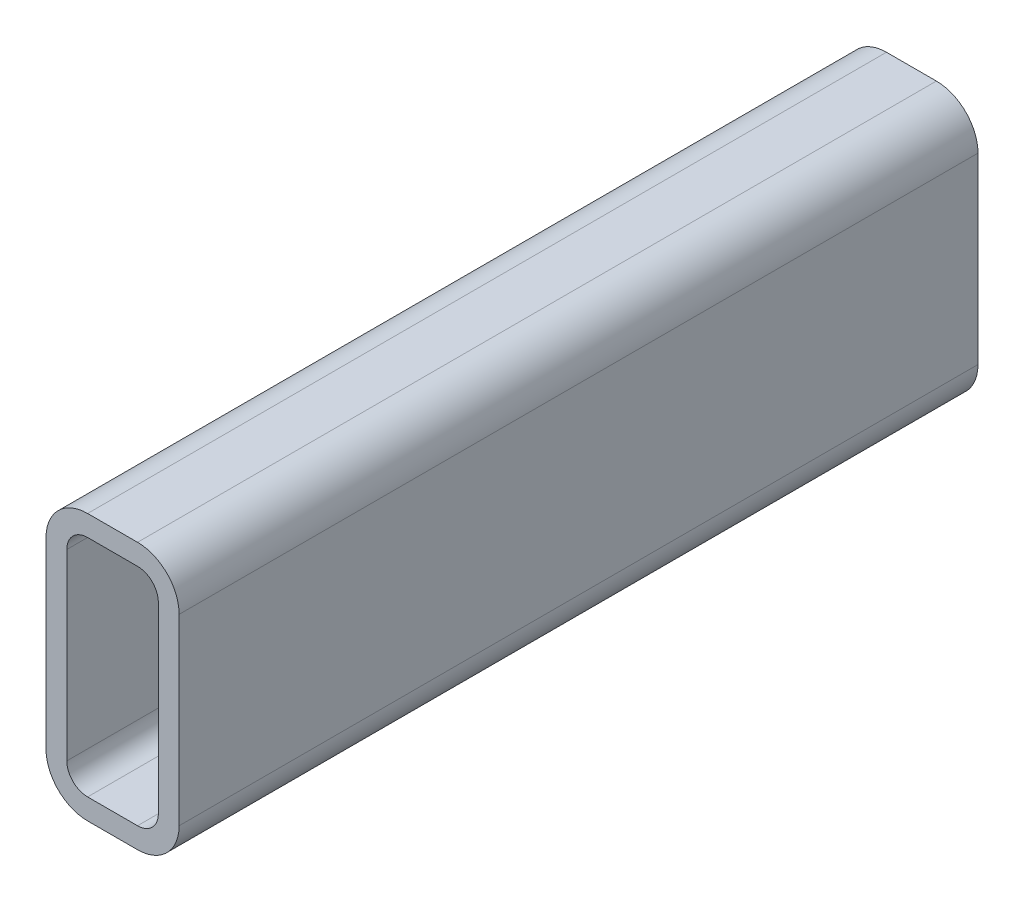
ISO-10303-21;
HEADER;
FILE_DESCRIPTION(('STEP AP214'),'2;1');
FILE_NAME('part.step','',(''),(''),'','','');
FILE_SCHEMA(('AUTOMOTIVE_DESIGN { 1 0 10303 214 1 1 1 1 }'));
ENDSEC;
DATA;
#1=APPLICATION_CONTEXT('core data for automotive mechanical design processes');
#2=APPLICATION_PROTOCOL_DEFINITION('international standard','automotive_design',2000,#1);
#3=PRODUCT_CONTEXT('',#1,'mechanical');
#4=PRODUCT('Part','Part','',(#3));
#5=PRODUCT_RELATED_PRODUCT_CATEGORY('part','',(#4));
#6=PRODUCT_DEFINITION_FORMATION('','',#4);
#7=PRODUCT_DEFINITION_CONTEXT('part definition',#1,'design');
#8=PRODUCT_DEFINITION('design','',#6,#7);
#9=PRODUCT_DEFINITION_SHAPE('','',#8);
#10=(LENGTH_UNIT() NAMED_UNIT(*) SI_UNIT(.MILLI.,.METRE.));
#11=(NAMED_UNIT(*) PLANE_ANGLE_UNIT() SI_UNIT($,.RADIAN.));
#12=(NAMED_UNIT(*) SI_UNIT($,.STERADIAN.) SOLID_ANGLE_UNIT());
#13=UNCERTAINTY_MEASURE_WITH_UNIT(LENGTH_MEASURE(1.E-05),#10,'distance_accuracy_value','');
#14=(GEOMETRIC_REPRESENTATION_CONTEXT(3) GLOBAL_UNCERTAINTY_ASSIGNED_CONTEXT((#13)) GLOBAL_UNIT_ASSIGNED_CONTEXT((#10,
#11,#12)) REPRESENTATION_CONTEXT('',''));
#15=CARTESIAN_POINT('',(0.,0.,0.));
#16=DIRECTION('',(0.,0.,1.));
#17=DIRECTION('',(1.,0.,0.));
#18=AXIS2_PLACEMENT_3D('',#15,#16,#17);
#19=CARTESIAN_POINT('',(15.875,85.725,304.8));
#20=DIRECTION('',(0.,0.,1.));
#21=DIRECTION('',(1.,0.,0.));
#22=AXIS2_PLACEMENT_3D('',#19,#20,#21);
#23=PLANE('',#22);
#24=CARTESIAN_POINT('',(15.875,85.725,304.8));
#25=DIRECTION('',(0.,0.,1.));
#26=DIRECTION('',(1.,0.,0.));
#27=AXIS2_PLACEMENT_3D('',#24,#25,#26);
#28=CIRCLE('',#27,15.875);
#29=CARTESIAN_POINT('',(15.875,101.6,304.8));
#30=VERTEX_POINT('',#29);
#31=CARTESIAN_POINT('',(0.,85.725,304.8));
#32=VERTEX_POINT('',#31);
#33=EDGE_CURVE('E211',#30,#32,#28,.T.);
#34=ORIENTED_EDGE('',*,*,#33,.T.);
#35=DIRECTION('',(0.,-1.,0.));
#36=VECTOR('',#35,1.);
#37=CARTESIAN_POINT('',(0.,15.875,304.8));
#38=LINE('',#37,#36);
#39=CARTESIAN_POINT('',(0.,15.875,304.8));
#40=VERTEX_POINT('',#39);
#41=EDGE_CURVE('E214',#32,#40,#38,.T.);
#42=ORIENTED_EDGE('',*,*,#41,.T.);
#43=CARTESIAN_POINT('',(15.875,15.875,304.8));
#44=DIRECTION('',(0.,0.,1.));
#45=DIRECTION('',(1.,0.,0.));
#46=AXIS2_PLACEMENT_3D('',#43,#44,#45);
#47=CIRCLE('',#46,15.875);
#48=CARTESIAN_POINT('',(15.875,0.,304.8));
#49=VERTEX_POINT('',#48);
#50=EDGE_CURVE('E217',#40,#49,#47,.T.);
#51=ORIENTED_EDGE('',*,*,#50,.T.);
#52=DIRECTION('',(1.,0.,0.));
#53=VECTOR('',#52,1.);
#54=CARTESIAN_POINT('',(34.925,0.,304.8));
#55=LINE('',#54,#53);
#56=CARTESIAN_POINT('',(34.925,0.,304.8));
#57=VERTEX_POINT('',#56);
#58=EDGE_CURVE('E219',#49,#57,#55,.T.);
#59=ORIENTED_EDGE('',*,*,#58,.T.);
#60=CARTESIAN_POINT('',(34.925,15.875,304.8));
#61=DIRECTION('',(0.,0.,1.));
#62=DIRECTION('',(1.,0.,0.));
#63=AXIS2_PLACEMENT_3D('',#60,#61,#62);
#64=CIRCLE('',#63,15.875);
#65=CARTESIAN_POINT('',(50.8,15.875,304.8));
#66=VERTEX_POINT('',#65);
#67=EDGE_CURVE('E221',#57,#66,#64,.T.);
#68=ORIENTED_EDGE('',*,*,#67,.T.);
#69=DIRECTION('',(0.,1.,0.));
#70=VECTOR('',#69,1.);
#71=CARTESIAN_POINT('',(50.8,85.725,304.8));
#72=LINE('',#71,#70);
#73=CARTESIAN_POINT('',(50.8,85.725,304.8));
#74=VERTEX_POINT('',#73);
#75=EDGE_CURVE('E223',#66,#74,#72,.T.);
#76=ORIENTED_EDGE('',*,*,#75,.T.);
#77=CARTESIAN_POINT('',(34.925,85.725,304.8));
#78=DIRECTION('',(0.,0.,1.));
#79=DIRECTION('',(1.,0.,0.));
#80=AXIS2_PLACEMENT_3D('',#77,#78,#79);
#81=CIRCLE('',#80,15.875);
#82=CARTESIAN_POINT('',(34.925,101.6,304.8));
#83=VERTEX_POINT('',#82);
#84=EDGE_CURVE('E225',#74,#83,#81,.T.);
#85=ORIENTED_EDGE('',*,*,#84,.T.);
#86=DIRECTION('',(-1.,0.,0.));
#87=VECTOR('',#86,1.);
#88=CARTESIAN_POINT('',(15.875,101.6,304.8));
#89=LINE('',#88,#87);
#90=EDGE_CURVE('E227',#83,#30,#89,.T.);
#91=ORIENTED_EDGE('',*,*,#90,.T.);
#92=EDGE_LOOP('',(#34,#42,#51,#59,#68,#76,#85,#91));
#93=FACE_BOUND('',#92,.T.);
#94=DIRECTION('',(0.,-1.,0.));
#95=VECTOR('',#94,1.);
#96=CARTESIAN_POINT('',(7.9375,15.875,304.8));
#97=LINE('',#96,#95);
#98=CARTESIAN_POINT('',(7.9375,85.725,304.8));
#99=VERTEX_POINT('',#98);
#100=CARTESIAN_POINT('',(7.9375,15.875,304.8));
#101=VERTEX_POINT('',#100);
#102=EDGE_CURVE('E154',#99,#101,#97,.T.);
#103=ORIENTED_EDGE('',*,*,#102,.F.);
#104=CARTESIAN_POINT('',(15.875,85.725,304.8));
#105=DIRECTION('',(0.,0.,1.));
#106=DIRECTION('',(1.,0.,0.));
#107=AXIS2_PLACEMENT_3D('',#104,#105,#106);
#108=CIRCLE('',#107,7.93750000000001);
#109=CARTESIAN_POINT('',(15.875,93.6625,304.8));
#110=VERTEX_POINT('',#109);
#111=EDGE_CURVE('E146',#110,#99,#108,.T.);
#112=ORIENTED_EDGE('',*,*,#111,.F.);
#113=DIRECTION('',(-1.,0.,0.));
#114=VECTOR('',#113,1.);
#115=CARTESIAN_POINT('',(15.875,93.6625,304.8));
#116=LINE('',#115,#114);
#117=CARTESIAN_POINT('',(34.925,93.6625,304.8));
#118=VERTEX_POINT('',#117);
#119=EDGE_CURVE('E179',#118,#110,#116,.T.);
#120=ORIENTED_EDGE('',*,*,#119,.F.);
#121=CARTESIAN_POINT('',(34.925,85.725,304.8));
#122=DIRECTION('',(0.,0.,1.));
#123=DIRECTION('',(1.,0.,0.));
#124=AXIS2_PLACEMENT_3D('',#121,#122,#123);
#125=CIRCLE('',#124,7.93750000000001);
#126=CARTESIAN_POINT('',(42.8625,85.725,304.8));
#127=VERTEX_POINT('',#126);
#128=EDGE_CURVE('E177',#127,#118,#125,.T.);
#129=ORIENTED_EDGE('',*,*,#128,.F.);
#130=DIRECTION('',(0.,1.,0.));
#131=VECTOR('',#130,1.);
#132=CARTESIAN_POINT('',(42.8625,85.725,304.8));
#133=LINE('',#132,#131);
#134=CARTESIAN_POINT('',(42.8625,15.875,304.8));
#135=VERTEX_POINT('',#134);
#136=EDGE_CURVE('E175',#135,#127,#133,.T.);
#137=ORIENTED_EDGE('',*,*,#136,.F.);
#138=CARTESIAN_POINT('',(34.925,15.875,304.8));
#139=DIRECTION('',(0.,0.,1.));
#140=DIRECTION('',(1.,0.,0.));
#141=AXIS2_PLACEMENT_3D('',#138,#139,#140);
#142=CIRCLE('',#141,7.9375);
#143=CARTESIAN_POINT('',(34.925,7.9375,304.8));
#144=VERTEX_POINT('',#143);
#145=EDGE_CURVE('E173',#144,#135,#142,.T.);
#146=ORIENTED_EDGE('',*,*,#145,.F.);
#147=DIRECTION('',(1.,0.,0.));
#148=VECTOR('',#147,1.);
#149=CARTESIAN_POINT('',(34.925,7.9375,304.8));
#150=LINE('',#149,#148);
#151=CARTESIAN_POINT('',(15.875,7.9375,304.8));
#152=VERTEX_POINT('',#151);
#153=EDGE_CURVE('E169',#152,#144,#150,.T.);
#154=ORIENTED_EDGE('',*,*,#153,.F.);
#155=CARTESIAN_POINT('',(15.875,15.875,304.8));
#156=DIRECTION('',(0.,0.,1.));
#157=DIRECTION('',(1.,0.,0.));
#158=AXIS2_PLACEMENT_3D('',#155,#156,#157);
#159=CIRCLE('',#158,7.9375);
#160=EDGE_CURVE('E167',#101,#152,#159,.T.);
#161=ORIENTED_EDGE('',*,*,#160,.F.);
#162=EDGE_LOOP('',(#103,#112,#120,#129,#137,#146,#154,#161));
#163=FACE_BOUND('',#162,.T.);
#164=ADVANCED_FACE('F33',(#93,#163),#23,.T.);
#165=CARTESIAN_POINT('',(15.875,85.725,0.));
#166=DIRECTION('',(0.,0.,1.));
#167=DIRECTION('',(1.,0.,0.));
#168=AXIS2_PLACEMENT_3D('',#165,#166,#167);
#169=PLANE('',#168);
#170=CARTESIAN_POINT('',(15.875,85.725,0.));
#171=DIRECTION('',(0.,0.,1.));
#172=DIRECTION('',(1.,0.,0.));
#173=AXIS2_PLACEMENT_3D('',#170,#171,#172);
#174=CIRCLE('',#173,15.875);
#175=CARTESIAN_POINT('',(15.875,101.6,0.));
#176=VERTEX_POINT('',#175);
#177=CARTESIAN_POINT('',(0.,85.725,0.));
#178=VERTEX_POINT('',#177);
#179=EDGE_CURVE('E162',#176,#178,#174,.T.);
#180=ORIENTED_EDGE('',*,*,#179,.F.);
#181=DIRECTION('',(-1.,0.,0.));
#182=VECTOR('',#181,1.);
#183=CARTESIAN_POINT('',(15.875,101.6,0.));
#184=LINE('',#183,#182);
#185=CARTESIAN_POINT('',(34.925,101.6,0.));
#186=VERTEX_POINT('',#185);
#187=EDGE_CURVE('E215',#186,#176,#184,.T.);
#188=ORIENTED_EDGE('',*,*,#187,.F.);
#189=CARTESIAN_POINT('',(34.925,85.725,0.));
#190=DIRECTION('',(0.,0.,1.));
#191=DIRECTION('',(1.,0.,0.));
#192=AXIS2_PLACEMENT_3D('',#189,#190,#191);
#193=CIRCLE('',#192,15.875);
#194=CARTESIAN_POINT('',(50.8,85.725,0.));
#195=VERTEX_POINT('',#194);
#196=EDGE_CURVE('E242',#195,#186,#193,.T.);
#197=ORIENTED_EDGE('',*,*,#196,.F.);
#198=DIRECTION('',(0.,1.,0.));
#199=VECTOR('',#198,1.);
#200=CARTESIAN_POINT('',(50.8,85.725,0.));
#201=LINE('',#200,#199);
#202=CARTESIAN_POINT('',(50.8,15.875,0.));
#203=VERTEX_POINT('',#202);
#204=EDGE_CURVE('E240',#203,#195,#201,.T.);
#205=ORIENTED_EDGE('',*,*,#204,.F.);
#206=CARTESIAN_POINT('',(34.925,15.875,0.));
#207=DIRECTION('',(0.,0.,1.));
#208=DIRECTION('',(1.,0.,0.));
#209=AXIS2_PLACEMENT_3D('',#206,#207,#208);
#210=CIRCLE('',#209,15.875);
#211=CARTESIAN_POINT('',(34.925,0.,0.));
#212=VERTEX_POINT('',#211);
#213=EDGE_CURVE('E238',#212,#203,#210,.T.);
#214=ORIENTED_EDGE('',*,*,#213,.F.);
#215=DIRECTION('',(1.,0.,0.));
#216=VECTOR('',#215,1.);
#217=CARTESIAN_POINT('',(34.925,0.,0.));
#218=LINE('',#217,#216);
#219=CARTESIAN_POINT('',(15.875,0.,0.));
#220=VERTEX_POINT('',#219);
#221=EDGE_CURVE('E236',#220,#212,#218,.T.);
#222=ORIENTED_EDGE('',*,*,#221,.F.);
#223=CARTESIAN_POINT('',(15.875,15.875,0.));
#224=DIRECTION('',(0.,0.,1.));
#225=DIRECTION('',(1.,0.,0.));
#226=AXIS2_PLACEMENT_3D('',#223,#224,#225);
#227=CIRCLE('',#226,15.875);
#228=CARTESIAN_POINT('',(0.,15.875,0.));
#229=VERTEX_POINT('',#228);
#230=EDGE_CURVE('E234',#229,#220,#227,.T.);
#231=ORIENTED_EDGE('',*,*,#230,.F.);
#232=DIRECTION('',(0.,-1.,0.));
#233=VECTOR('',#232,1.);
#234=CARTESIAN_POINT('',(0.,15.875,0.));
#235=LINE('',#234,#233);
#236=EDGE_CURVE('E232',#178,#229,#235,.T.);
#237=ORIENTED_EDGE('',*,*,#236,.F.);
#238=EDGE_LOOP('',(#180,#188,#197,#205,#214,#222,#231,#237));
#239=FACE_BOUND('',#238,.T.);
#240=CARTESIAN_POINT('',(15.875,85.725,0.));
#241=DIRECTION('',(0.,0.,1.));
#242=DIRECTION('',(1.,0.,0.));
#243=AXIS2_PLACEMENT_3D('',#240,#241,#242);
#244=CIRCLE('',#243,7.93750000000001);
#245=CARTESIAN_POINT('',(15.875,93.6625,0.));
#246=VERTEX_POINT('',#245);
#247=CARTESIAN_POINT('',(7.9375,85.725,0.));
#248=VERTEX_POINT('',#247);
#249=EDGE_CURVE('E56',#246,#248,#244,.T.);
#250=ORIENTED_EDGE('',*,*,#249,.T.);
#251=DIRECTION('',(0.,-1.,0.));
#252=VECTOR('',#251,1.);
#253=CARTESIAN_POINT('',(7.9375,15.875,0.));
#254=LINE('',#253,#252);
#255=CARTESIAN_POINT('',(7.9375,15.875,0.));
#256=VERTEX_POINT('',#255);
#257=EDGE_CURVE('E161',#248,#256,#254,.T.);
#258=ORIENTED_EDGE('',*,*,#257,.T.);
#259=CARTESIAN_POINT('',(15.875,15.875,0.));
#260=DIRECTION('',(0.,0.,1.));
#261=DIRECTION('',(1.,0.,0.));
#262=AXIS2_PLACEMENT_3D('',#259,#260,#261);
#263=CIRCLE('',#262,7.9375);
#264=CARTESIAN_POINT('',(15.875,7.9375,0.));
#265=VERTEX_POINT('',#264);
#266=EDGE_CURVE('E183',#256,#265,#263,.T.);
#267=ORIENTED_EDGE('',*,*,#266,.T.);
#268=DIRECTION('',(1.,0.,0.));
#269=VECTOR('',#268,1.);
#270=CARTESIAN_POINT('',(34.925,7.9375,0.));
#271=LINE('',#270,#269);
#272=CARTESIAN_POINT('',(34.925,7.9375,0.));
#273=VERTEX_POINT('',#272);
#274=EDGE_CURVE('E186',#265,#273,#271,.T.);
#275=ORIENTED_EDGE('',*,*,#274,.T.);
#276=CARTESIAN_POINT('',(34.925,15.875,0.));
#277=DIRECTION('',(0.,0.,1.));
#278=DIRECTION('',(1.,0.,0.));
#279=AXIS2_PLACEMENT_3D('',#276,#277,#278);
#280=CIRCLE('',#279,7.9375);
#281=CARTESIAN_POINT('',(42.8625,15.875,0.));
#282=VERTEX_POINT('',#281);
#283=EDGE_CURVE('E189',#273,#282,#280,.T.);
#284=ORIENTED_EDGE('',*,*,#283,.T.);
#285=DIRECTION('',(0.,1.,0.));
#286=VECTOR('',#285,1.);
#287=CARTESIAN_POINT('',(42.8625,85.725,0.));
#288=LINE('',#287,#286);
#289=CARTESIAN_POINT('',(42.8625,85.725,0.));
#290=VERTEX_POINT('',#289);
#291=EDGE_CURVE('E192',#282,#290,#288,.T.);
#292=ORIENTED_EDGE('',*,*,#291,.T.);
#293=CARTESIAN_POINT('',(34.925,85.725,0.));
#294=DIRECTION('',(0.,0.,1.));
#295=DIRECTION('',(1.,0.,0.));
#296=AXIS2_PLACEMENT_3D('',#293,#294,#295);
#297=CIRCLE('',#296,7.93750000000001);
#298=CARTESIAN_POINT('',(34.925,93.6625,0.));
#299=VERTEX_POINT('',#298);
#300=EDGE_CURVE('E195',#290,#299,#297,.T.);
#301=ORIENTED_EDGE('',*,*,#300,.T.);
#302=DIRECTION('',(-1.,0.,0.));
#303=VECTOR('',#302,1.);
#304=CARTESIAN_POINT('',(15.875,93.6625,0.));
#305=LINE('',#304,#303);
#306=EDGE_CURVE('E155',#299,#246,#305,.T.);
#307=ORIENTED_EDGE('',*,*,#306,.T.);
#308=EDGE_LOOP('',(#250,#258,#267,#275,#284,#292,#301,#307));
#309=FACE_BOUND('',#308,.T.);
#310=ADVANCED_FACE('F272',(#239,#309),#169,.F.);
#311=CARTESIAN_POINT('',(15.875,85.725,304.8));
#312=DIRECTION('',(0.,0.,-1.));
#313=DIRECTION('',(-1.,0.,0.));
#314=AXIS2_PLACEMENT_3D('',#311,#312,#313);
#315=CYLINDRICAL_SURFACE('',#314,15.875);
#316=ORIENTED_EDGE('',*,*,#179,.T.);
#317=DIRECTION('',(0.,0.,-1.));
#318=VECTOR('',#317,1.);
#319=CARTESIAN_POINT('',(0.,85.725,304.8));
#320=LINE('',#319,#318);
#321=EDGE_CURVE('E11',#32,#178,#320,.T.);
#322=ORIENTED_EDGE('',*,*,#321,.F.);
#323=ORIENTED_EDGE('',*,*,#33,.F.);
#324=DIRECTION('',(0.,0.,-1.));
#325=VECTOR('',#324,1.);
#326=CARTESIAN_POINT('',(15.875,101.6,304.8));
#327=LINE('',#326,#325);
#328=EDGE_CURVE('E229',#30,#176,#327,.T.);
#329=ORIENTED_EDGE('',*,*,#328,.T.);
#330=EDGE_LOOP('',(#316,#322,#323,#329));
#331=FACE_BOUND('',#330,.T.);
#332=ADVANCED_FACE('F35',(#331),#315,.T.);
#333=CARTESIAN_POINT('',(0.,15.875,304.8));
#334=DIRECTION('',(1.,0.,0.));
#335=DIRECTION('',(0.,0.,-1.));
#336=AXIS2_PLACEMENT_3D('',#333,#334,#335);
#337=PLANE('',#336);
#338=ORIENTED_EDGE('',*,*,#236,.T.);
#339=DIRECTION('',(0.,0.,-1.));
#340=VECTOR('',#339,1.);
#341=CARTESIAN_POINT('',(0.,15.875,304.8));
#342=LINE('',#341,#340);
#343=EDGE_CURVE('E41',#40,#229,#342,.T.);
#344=ORIENTED_EDGE('',*,*,#343,.F.);
#345=ORIENTED_EDGE('',*,*,#41,.F.);
#346=ORIENTED_EDGE('',*,*,#321,.T.);
#347=EDGE_LOOP('',(#338,#344,#345,#346));
#348=FACE_BOUND('',#347,.T.);
#349=ADVANCED_FACE('F289',(#348),#337,.F.);
#350=CARTESIAN_POINT('',(15.875,15.875,304.8));
#351=DIRECTION('',(0.,0.,-1.));
#352=DIRECTION('',(-1.,0.,0.));
#353=AXIS2_PLACEMENT_3D('',#350,#351,#352);
#354=CYLINDRICAL_SURFACE('',#353,15.875);
#355=ORIENTED_EDGE('',*,*,#230,.T.);
#356=DIRECTION('',(0.,0.,-1.));
#357=VECTOR('',#356,1.);
#358=CARTESIAN_POINT('',(15.875,0.,304.8));
#359=LINE('',#358,#357);
#360=EDGE_CURVE('E259',#49,#220,#359,.T.);
#361=ORIENTED_EDGE('',*,*,#360,.F.);
#362=ORIENTED_EDGE('',*,*,#50,.F.);
#363=ORIENTED_EDGE('',*,*,#343,.T.);
#364=EDGE_LOOP('',(#355,#361,#362,#363));
#365=FACE_BOUND('',#364,.T.);
#366=ADVANCED_FACE('F266',(#365),#354,.T.);
#367=CARTESIAN_POINT('',(34.925,0.,304.8));
#368=DIRECTION('',(0.,1.,0.));
#369=DIRECTION('',(0.,0.,1.));
#370=AXIS2_PLACEMENT_3D('',#367,#368,#369);
#371=PLANE('',#370);
#372=ORIENTED_EDGE('',*,*,#221,.T.);
#373=DIRECTION('',(0.,0.,-1.));
#374=VECTOR('',#373,1.);
#375=CARTESIAN_POINT('',(34.925,0.,304.8));
#376=LINE('',#375,#374);
#377=EDGE_CURVE('E256',#57,#212,#376,.T.);
#378=ORIENTED_EDGE('',*,*,#377,.F.);
#379=ORIENTED_EDGE('',*,*,#58,.F.);
#380=ORIENTED_EDGE('',*,*,#360,.T.);
#381=EDGE_LOOP('',(#372,#378,#379,#380));
#382=FACE_BOUND('',#381,.T.);
#383=ADVANCED_FACE('F278',(#382),#371,.F.);
#384=CARTESIAN_POINT('',(34.925,15.875,304.8));
#385=DIRECTION('',(0.,0.,-1.));
#386=DIRECTION('',(-1.,0.,0.));
#387=AXIS2_PLACEMENT_3D('',#384,#385,#386);
#388=CYLINDRICAL_SURFACE('',#387,15.875);
#389=ORIENTED_EDGE('',*,*,#213,.T.);
#390=DIRECTION('',(0.,0.,-1.));
#391=VECTOR('',#390,1.);
#392=CARTESIAN_POINT('',(50.8,15.875,304.8));
#393=LINE('',#392,#391);
#394=EDGE_CURVE('E253',#66,#203,#393,.T.);
#395=ORIENTED_EDGE('',*,*,#394,.F.);
#396=ORIENTED_EDGE('',*,*,#67,.F.);
#397=ORIENTED_EDGE('',*,*,#377,.T.);
#398=EDGE_LOOP('',(#389,#395,#396,#397));
#399=FACE_BOUND('',#398,.T.);
#400=ADVANCED_FACE('F282',(#399),#388,.T.);
#401=CARTESIAN_POINT('',(50.8,85.725,304.8));
#402=DIRECTION('',(-1.,0.,0.));
#403=DIRECTION('',(0.,0.,1.));
#404=AXIS2_PLACEMENT_3D('',#401,#402,#403);
#405=PLANE('',#404);
#406=ORIENTED_EDGE('',*,*,#204,.T.);
#407=DIRECTION('',(0.,0.,-1.));
#408=VECTOR('',#407,1.);
#409=CARTESIAN_POINT('',(50.8,85.725,304.8));
#410=LINE('',#409,#408);
#411=EDGE_CURVE('E250',#74,#195,#410,.T.);
#412=ORIENTED_EDGE('',*,*,#411,.F.);
#413=ORIENTED_EDGE('',*,*,#75,.F.);
#414=ORIENTED_EDGE('',*,*,#394,.T.);
#415=EDGE_LOOP('',(#406,#412,#413,#414));
#416=FACE_BOUND('',#415,.T.);
#417=ADVANCED_FACE('F302',(#416),#405,.F.);
#418=CARTESIAN_POINT('',(34.925,85.725,304.8));
#419=DIRECTION('',(0.,0.,-1.));
#420=DIRECTION('',(-1.,0.,0.));
#421=AXIS2_PLACEMENT_3D('',#418,#419,#420);
#422=CYLINDRICAL_SURFACE('',#421,15.875);
#423=ORIENTED_EDGE('',*,*,#196,.T.);
#424=DIRECTION('',(0.,0.,-1.));
#425=VECTOR('',#424,1.);
#426=CARTESIAN_POINT('',(34.925,101.6,304.8));
#427=LINE('',#426,#425);
#428=EDGE_CURVE('E247',#83,#186,#427,.T.);
#429=ORIENTED_EDGE('',*,*,#428,.F.);
#430=ORIENTED_EDGE('',*,*,#84,.F.);
#431=ORIENTED_EDGE('',*,*,#411,.T.);
#432=EDGE_LOOP('',(#423,#429,#430,#431));
#433=FACE_BOUND('',#432,.T.);
#434=ADVANCED_FACE('F300',(#433),#422,.T.);
#435=CARTESIAN_POINT('',(15.875,101.6,304.8));
#436=DIRECTION('',(0.,-1.,0.));
#437=DIRECTION('',(0.,0.,-1.));
#438=AXIS2_PLACEMENT_3D('',#435,#436,#437);
#439=PLANE('',#438);
#440=ORIENTED_EDGE('',*,*,#187,.T.);
#441=ORIENTED_EDGE('',*,*,#328,.F.);
#442=ORIENTED_EDGE('',*,*,#90,.F.);
#443=ORIENTED_EDGE('',*,*,#428,.T.);
#444=EDGE_LOOP('',(#440,#441,#442,#443));
#445=FACE_BOUND('',#444,.T.);
#446=ADVANCED_FACE('F295',(#445),#439,.F.);
#447=CARTESIAN_POINT('',(15.875,85.725,304.8));
#448=DIRECTION('',(0.,0.,-1.));
#449=DIRECTION('',(-1.,0.,0.));
#450=AXIS2_PLACEMENT_3D('',#447,#448,#449);
#451=CYLINDRICAL_SURFACE('',#450,7.93750000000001);
#452=ORIENTED_EDGE('',*,*,#249,.F.);
#453=DIRECTION('',(0.,0.,-1.));
#454=VECTOR('',#453,1.);
#455=CARTESIAN_POINT('',(15.875,93.6625,304.8));
#456=LINE('',#455,#454);
#457=EDGE_CURVE('E150',#110,#246,#456,.T.);
#458=ORIENTED_EDGE('',*,*,#457,.F.);
#459=ORIENTED_EDGE('',*,*,#111,.T.);
#460=DIRECTION('',(0.,0.,-1.));
#461=VECTOR('',#460,1.);
#462=CARTESIAN_POINT('',(7.9375,85.725,304.8));
#463=LINE('',#462,#461);
#464=EDGE_CURVE('E149',#99,#248,#463,.T.);
#465=ORIENTED_EDGE('',*,*,#464,.T.);
#466=EDGE_LOOP('',(#452,#458,#459,#465));
#467=FACE_BOUND('',#466,.T.);
#468=ADVANCED_FACE('F148',(#467),#451,.F.);
#469=CARTESIAN_POINT('',(7.9375,15.875,304.8));
#470=DIRECTION('',(1.,0.,0.));
#471=DIRECTION('',(0.,0.,-1.));
#472=AXIS2_PLACEMENT_3D('',#469,#470,#471);
#473=PLANE('',#472);
#474=ORIENTED_EDGE('',*,*,#257,.F.);
#475=ORIENTED_EDGE('',*,*,#464,.F.);
#476=ORIENTED_EDGE('',*,*,#102,.T.);
#477=DIRECTION('',(0.,0.,-1.));
#478=VECTOR('',#477,1.);
#479=CARTESIAN_POINT('',(7.9375,15.875,304.8));
#480=LINE('',#479,#478);
#481=EDGE_CURVE('E163',#101,#256,#480,.T.);
#482=ORIENTED_EDGE('',*,*,#481,.T.);
#483=EDGE_LOOP('',(#474,#475,#476,#482));
#484=FACE_BOUND('',#483,.T.);
#485=ADVANCED_FACE('F158',(#484),#473,.T.);
#486=CARTESIAN_POINT('',(15.875,15.875,304.8));
#487=DIRECTION('',(0.,0.,-1.));
#488=DIRECTION('',(-1.,0.,0.));
#489=AXIS2_PLACEMENT_3D('',#486,#487,#488);
#490=CYLINDRICAL_SURFACE('',#489,7.9375);
#491=ORIENTED_EDGE('',*,*,#266,.F.);
#492=ORIENTED_EDGE('',*,*,#481,.F.);
#493=ORIENTED_EDGE('',*,*,#160,.T.);
#494=DIRECTION('',(0.,0.,-1.));
#495=VECTOR('',#494,1.);
#496=CARTESIAN_POINT('',(15.875,7.9375,304.8));
#497=LINE('',#496,#495);
#498=EDGE_CURVE('E208',#152,#265,#497,.T.);
#499=ORIENTED_EDGE('',*,*,#498,.T.);
#500=EDGE_LOOP('',(#491,#492,#493,#499));
#501=FACE_BOUND('',#500,.T.);
#502=ADVANCED_FACE('F327',(#501),#490,.F.);
#503=CARTESIAN_POINT('',(34.925,7.9375,304.8));
#504=DIRECTION('',(0.,1.,0.));
#505=DIRECTION('',(0.,0.,1.));
#506=AXIS2_PLACEMENT_3D('',#503,#504,#505);
#507=PLANE('',#506);
#508=ORIENTED_EDGE('',*,*,#274,.F.);
#509=ORIENTED_EDGE('',*,*,#498,.F.);
#510=ORIENTED_EDGE('',*,*,#153,.T.);
#511=DIRECTION('',(0.,0.,-1.));
#512=VECTOR('',#511,1.);
#513=CARTESIAN_POINT('',(34.925,7.9375,304.8));
#514=LINE('',#513,#512);
#515=EDGE_CURVE('E206',#144,#273,#514,.T.);
#516=ORIENTED_EDGE('',*,*,#515,.T.);
#517=EDGE_LOOP('',(#508,#509,#510,#516));
#518=FACE_BOUND('',#517,.T.);
#519=ADVANCED_FACE('F331',(#518),#507,.T.);
#520=CARTESIAN_POINT('',(34.925,15.875,304.8));
#521=DIRECTION('',(0.,0.,-1.));
#522=DIRECTION('',(-1.,0.,0.));
#523=AXIS2_PLACEMENT_3D('',#520,#521,#522);
#524=CYLINDRICAL_SURFACE('',#523,7.9375);
#525=ORIENTED_EDGE('',*,*,#283,.F.);
#526=ORIENTED_EDGE('',*,*,#515,.F.);
#527=ORIENTED_EDGE('',*,*,#145,.T.);
#528=DIRECTION('',(0.,0.,-1.));
#529=VECTOR('',#528,1.);
#530=CARTESIAN_POINT('',(42.8625,15.875,304.8));
#531=LINE('',#530,#529);
#532=EDGE_CURVE('E204',#135,#282,#531,.T.);
#533=ORIENTED_EDGE('',*,*,#532,.T.);
#534=EDGE_LOOP('',(#525,#526,#527,#533));
#535=FACE_BOUND('',#534,.T.);
#536=ADVANCED_FACE('F337',(#535),#524,.F.);
#537=CARTESIAN_POINT('',(42.8625,85.725,304.8));
#538=DIRECTION('',(-1.,0.,0.));
#539=DIRECTION('',(0.,0.,1.));
#540=AXIS2_PLACEMENT_3D('',#537,#538,#539);
#541=PLANE('',#540);
#542=ORIENTED_EDGE('',*,*,#291,.F.);
#543=ORIENTED_EDGE('',*,*,#532,.F.);
#544=ORIENTED_EDGE('',*,*,#136,.T.);
#545=DIRECTION('',(0.,0.,-1.));
#546=VECTOR('',#545,1.);
#547=CARTESIAN_POINT('',(42.8625,85.725,304.8));
#548=LINE('',#547,#546);
#549=EDGE_CURVE('E202',#127,#290,#548,.T.);
#550=ORIENTED_EDGE('',*,*,#549,.T.);
#551=EDGE_LOOP('',(#542,#543,#544,#550));
#552=FACE_BOUND('',#551,.T.);
#553=ADVANCED_FACE('F341',(#552),#541,.T.);
#554=CARTESIAN_POINT('',(34.925,85.725,304.8));
#555=DIRECTION('',(0.,0.,-1.));
#556=DIRECTION('',(-1.,0.,0.));
#557=AXIS2_PLACEMENT_3D('',#554,#555,#556);
#558=CYLINDRICAL_SURFACE('',#557,7.93750000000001);
#559=ORIENTED_EDGE('',*,*,#300,.F.);
#560=ORIENTED_EDGE('',*,*,#549,.F.);
#561=ORIENTED_EDGE('',*,*,#128,.T.);
#562=DIRECTION('',(0.,0.,-1.));
#563=VECTOR('',#562,1.);
#564=CARTESIAN_POINT('',(34.925,93.6625,304.8));
#565=LINE('',#564,#563);
#566=EDGE_CURVE('E48',#118,#299,#565,.T.);
#567=ORIENTED_EDGE('',*,*,#566,.T.);
#568=EDGE_LOOP('',(#559,#560,#561,#567));
#569=FACE_BOUND('',#568,.T.);
#570=ADVANCED_FACE('F345',(#569),#558,.F.);
#571=CARTESIAN_POINT('',(15.875,93.6625,304.8));
#572=DIRECTION('',(0.,-1.,0.));
#573=DIRECTION('',(0.,0.,-1.));
#574=AXIS2_PLACEMENT_3D('',#571,#572,#573);
#575=PLANE('',#574);
#576=ORIENTED_EDGE('',*,*,#306,.F.);
#577=ORIENTED_EDGE('',*,*,#566,.F.);
#578=ORIENTED_EDGE('',*,*,#119,.T.);
#579=ORIENTED_EDGE('',*,*,#457,.T.);
#580=EDGE_LOOP('',(#576,#577,#578,#579));
#581=FACE_BOUND('',#580,.T.);
#582=ADVANCED_FACE('F349',(#581),#575,.T.);
#583=CLOSED_SHELL('',(#164,#310,#332,#349,#366,#383,#400,#417,#434,#446,#468,#485,#502,#519,
#536,#553,#570,#582));
#584=MANIFOLD_SOLID_BREP('B2',#583);
#585=ADVANCED_BREP_SHAPE_REPRESENTATION('',(#18,#584),#14);
#586=SHAPE_DEFINITION_REPRESENTATION(#9,#585);
ENDSEC;
END-ISO-10303-21;
